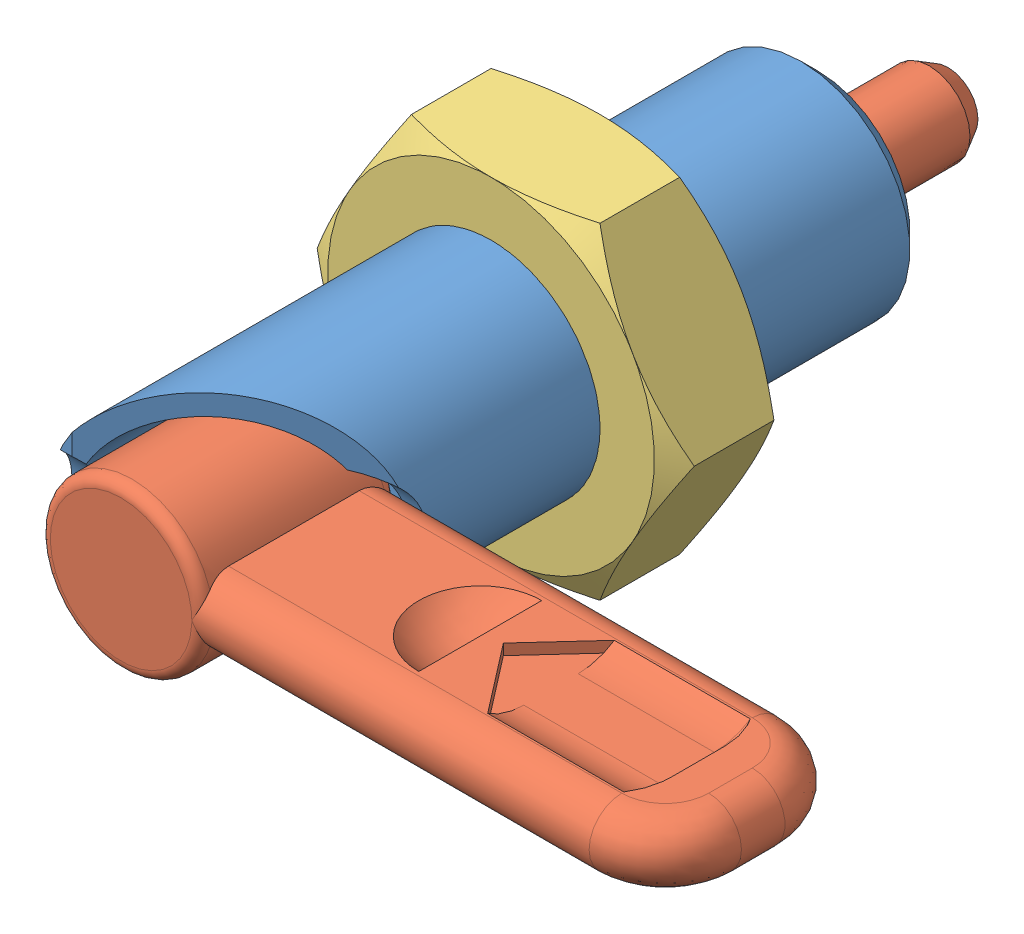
SolidWorks assembly GDX16LW-6N-SUS.sldasm, configuration Default (file format 15000). Lengths in mm.
Overall size (56.4 32.79 61.21).
3 component instances, 3 part files, 0 mates.
Components (placement in the parent):
- GDX16LW-6N-SUS_01-1: GDX16LW-6N-SUS_01.SLDPRT [ﾃﾞﾌｫﾙﾄ] x (1 0 0) z (0 -1 0) size (16.02 50.53 16.01)
- GDX16LW-6N-SUS_02-1: GDX16LW-6N-SUS_02.SLDPRT [ﾃﾞﾌｫﾙﾄ] x (1 0 0) z (0 -1 0) size (46 61.21 12)
- GDX16LW-6N-SUS_03-1: GDX16LW-6N-SUS_03.SLDPRT [ﾃﾞﾌｫﾙﾄ] at (0 0 16) x (0 0 1) z (0 1 0) size (8.01 32.79 32.79)
